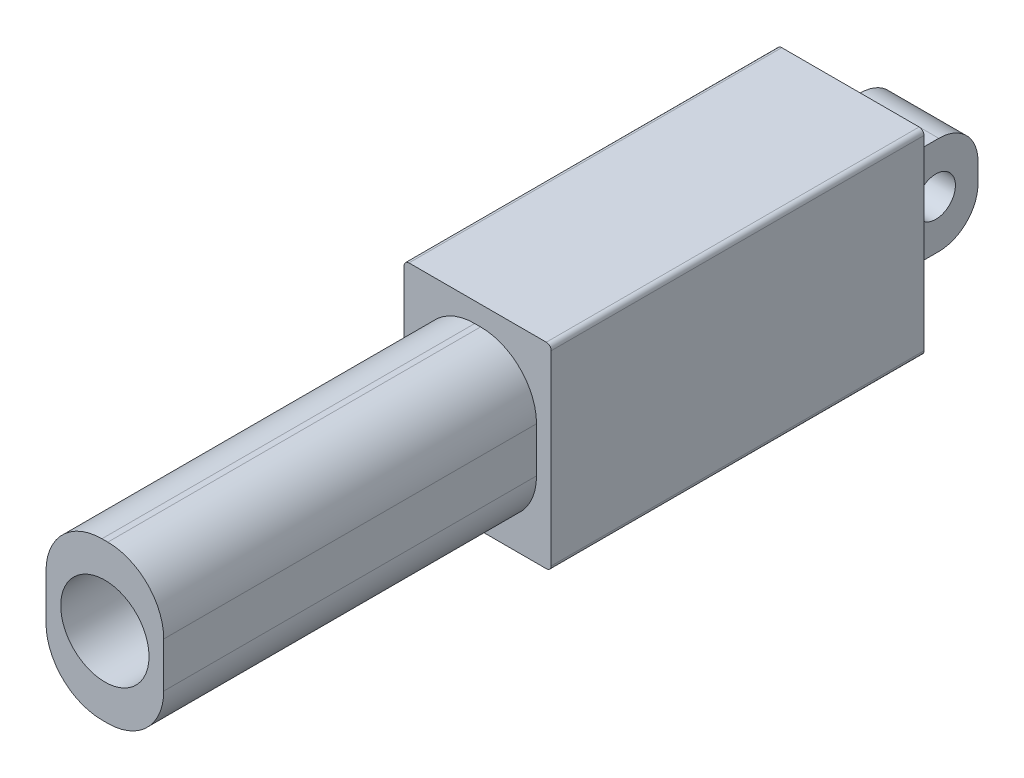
ISO-10303-21;
HEADER;
FILE_DESCRIPTION(('STEP AP214'),'2;1');
FILE_NAME('part.step','',(''),(''),'','','');
FILE_SCHEMA(('AUTOMOTIVE_DESIGN { 1 0 10303 214 1 1 1 1 }'));
ENDSEC;
DATA;
#1=APPLICATION_CONTEXT('core data for automotive mechanical design processes');
#2=APPLICATION_PROTOCOL_DEFINITION('international standard','automotive_design',2000,#1);
#3=PRODUCT_CONTEXT('',#1,'mechanical');
#4=PRODUCT('Part','Part','',(#3));
#5=PRODUCT_RELATED_PRODUCT_CATEGORY('part','',(#4));
#6=PRODUCT_DEFINITION_FORMATION('','',#4);
#7=PRODUCT_DEFINITION_CONTEXT('part definition',#1,'design');
#8=PRODUCT_DEFINITION('design','',#6,#7);
#9=PRODUCT_DEFINITION_SHAPE('','',#8);
#10=(LENGTH_UNIT() NAMED_UNIT(*) SI_UNIT(.MILLI.,.METRE.));
#11=(NAMED_UNIT(*) PLANE_ANGLE_UNIT() SI_UNIT($,.RADIAN.));
#12=(NAMED_UNIT(*) SI_UNIT($,.STERADIAN.) SOLID_ANGLE_UNIT());
#13=UNCERTAINTY_MEASURE_WITH_UNIT(LENGTH_MEASURE(1.E-05),#10,'distance_accuracy_value','');
#14=(GEOMETRIC_REPRESENTATION_CONTEXT(3) GLOBAL_UNCERTAINTY_ASSIGNED_CONTEXT((#13)) GLOBAL_UNIT_ASSIGNED_CONTEXT((#10,
#11,#12)) REPRESENTATION_CONTEXT('',''));
#15=CARTESIAN_POINT('',(0.,0.,0.));
#16=DIRECTION('',(0.,0.,1.));
#17=DIRECTION('',(1.,0.,0.));
#18=AXIS2_PLACEMENT_3D('',#15,#16,#17);
#19=CARTESIAN_POINT('',(0.,0.,0.));
#20=DIRECTION('',(0.,0.,1.));
#21=DIRECTION('',(1.,0.,0.));
#22=AXIS2_PLACEMENT_3D('',#19,#20,#21);
#23=PLANE('',#22);
#24=DIRECTION('',(-1.,0.,0.));
#25=VECTOR('',#24,1.);
#26=CARTESIAN_POINT('',(7.5,10.,0.));
#27=LINE('',#26,#25);
#28=CARTESIAN_POINT('',(7.,10.,0.));
#29=VERTEX_POINT('',#28);
#30=CARTESIAN_POINT('',(-7.,10.,0.));
#31=VERTEX_POINT('',#30);
#32=EDGE_CURVE('E290',#29,#31,#27,.T.);
#33=ORIENTED_EDGE('',*,*,#32,.F.);
#34=CARTESIAN_POINT('',(7.,9.5,0.));
#35=DIRECTION('',(0.,0.,1.));
#36=DIRECTION('',(1.,0.,0.));
#37=AXIS2_PLACEMENT_3D('',#34,#35,#36);
#38=CIRCLE('',#37,0.5);
#39=CARTESIAN_POINT('',(7.5,9.5,0.));
#40=VERTEX_POINT('',#39);
#41=EDGE_CURVE('E338',#29,#40,#38,.F.);
#42=ORIENTED_EDGE('',*,*,#41,.T.);
#43=DIRECTION('',(0.,1.,0.));
#44=VECTOR('',#43,1.);
#45=CARTESIAN_POINT('',(7.5,-10.,0.));
#46=LINE('',#45,#44);
#47=CARTESIAN_POINT('',(7.5,-9.5,0.));
#48=VERTEX_POINT('',#47);
#49=EDGE_CURVE('E303',#48,#40,#46,.T.);
#50=ORIENTED_EDGE('',*,*,#49,.F.);
#51=CARTESIAN_POINT('',(7.,-9.5,0.));
#52=DIRECTION('',(0.,0.,1.));
#53=DIRECTION('',(1.,0.,0.));
#54=AXIS2_PLACEMENT_3D('',#51,#52,#53);
#55=CIRCLE('',#54,0.5);
#56=CARTESIAN_POINT('',(7.,-10.,0.));
#57=VERTEX_POINT('',#56);
#58=EDGE_CURVE('E336',#48,#57,#55,.F.);
#59=ORIENTED_EDGE('',*,*,#58,.T.);
#60=DIRECTION('',(1.,0.,0.));
#61=VECTOR('',#60,1.);
#62=CARTESIAN_POINT('',(7.5,-10.,0.));
#63=LINE('',#62,#61);
#64=CARTESIAN_POINT('',(-7.,-10.,0.));
#65=VERTEX_POINT('',#64);
#66=EDGE_CURVE('E301',#65,#57,#63,.T.);
#67=ORIENTED_EDGE('',*,*,#66,.F.);
#68=CARTESIAN_POINT('',(-7.,-9.5,0.));
#69=DIRECTION('',(0.,0.,1.));
#70=DIRECTION('',(1.,0.,0.));
#71=AXIS2_PLACEMENT_3D('',#68,#69,#70);
#72=CIRCLE('',#71,0.5);
#73=CARTESIAN_POINT('',(-7.5,-9.5,0.));
#74=VERTEX_POINT('',#73);
#75=EDGE_CURVE('E332',#65,#74,#72,.F.);
#76=ORIENTED_EDGE('',*,*,#75,.T.);
#77=DIRECTION('',(0.,-1.,0.));
#78=VECTOR('',#77,1.);
#79=CARTESIAN_POINT('',(-7.5,-10.,0.));
#80=LINE('',#79,#78);
#81=CARTESIAN_POINT('',(-7.5,9.5,0.));
#82=VERTEX_POINT('',#81);
#83=EDGE_CURVE('E286',#82,#74,#80,.T.);
#84=ORIENTED_EDGE('',*,*,#83,.F.);
#85=CARTESIAN_POINT('',(-7.,9.5,0.));
#86=DIRECTION('',(0.,0.,1.));
#87=DIRECTION('',(1.,0.,0.));
#88=AXIS2_PLACEMENT_3D('',#85,#86,#87);
#89=CIRCLE('',#88,0.5);
#90=EDGE_CURVE('E334',#82,#31,#89,.F.);
#91=ORIENTED_EDGE('',*,*,#90,.T.);
#92=EDGE_LOOP('',(#33,#42,#50,#59,#67,#76,#84,#91));
#93=FACE_BOUND('',#92,.T.);
#94=DIRECTION('',(0.,1.,0.));
#95=VECTOR('',#94,1.);
#96=CARTESIAN_POINT('',(-4.,-5.,0.));
#97=LINE('',#96,#95);
#98=CARTESIAN_POINT('',(-4.,-5.,0.));
#99=VERTEX_POINT('',#98);
#100=CARTESIAN_POINT('',(-4.,5.,0.));
#101=VERTEX_POINT('',#100);
#102=EDGE_CURVE('E208',#99,#101,#97,.T.);
#103=ORIENTED_EDGE('',*,*,#102,.F.);
#104=DIRECTION('',(-1.,0.,0.));
#105=VECTOR('',#104,1.);
#106=CARTESIAN_POINT('',(4.,-5.,0.));
#107=LINE('',#106,#105);
#108=CARTESIAN_POINT('',(4.,-5.,0.));
#109=VERTEX_POINT('',#108);
#110=EDGE_CURVE('E204',#109,#99,#107,.T.);
#111=ORIENTED_EDGE('',*,*,#110,.F.);
#112=DIRECTION('',(0.,-1.,0.));
#113=VECTOR('',#112,1.);
#114=CARTESIAN_POINT('',(4.,-5.,0.));
#115=LINE('',#114,#113);
#116=CARTESIAN_POINT('',(4.,5.,0.));
#117=VERTEX_POINT('',#116);
#118=EDGE_CURVE('E188',#117,#109,#115,.T.);
#119=ORIENTED_EDGE('',*,*,#118,.F.);
#120=DIRECTION('',(1.,0.,0.));
#121=VECTOR('',#120,1.);
#122=CARTESIAN_POINT('',(4.,5.,0.));
#123=LINE('',#122,#121);
#124=EDGE_CURVE('E201',#101,#117,#123,.T.);
#125=ORIENTED_EDGE('',*,*,#124,.F.);
#126=EDGE_LOOP('',(#103,#111,#119,#125));
#127=FACE_BOUND('',#126,.T.);
#128=ADVANCED_FACE('F33',(#93,#127),#23,.F.);
#129=CARTESIAN_POINT('',(-7.5,-10.,38.));
#130=DIRECTION('',(1.,0.,0.));
#131=DIRECTION('',(0.,0.,-1.));
#132=AXIS2_PLACEMENT_3D('',#129,#130,#131);
#133=PLANE('',#132);
#134=DIRECTION('',(0.,-1.,0.));
#135=VECTOR('',#134,1.);
#136=CARTESIAN_POINT('',(-7.5,-10.,38.));
#137=LINE('',#136,#135);
#138=CARTESIAN_POINT('',(-7.5,9.5,38.));
#139=VERTEX_POINT('',#138);
#140=CARTESIAN_POINT('',(-7.5,-9.5,38.));
#141=VERTEX_POINT('',#140);
#142=EDGE_CURVE('E287',#139,#141,#137,.T.);
#143=ORIENTED_EDGE('',*,*,#142,.F.);
#144=DIRECTION('',(0.,0.,-1.));
#145=VECTOR('',#144,1.);
#146=CARTESIAN_POINT('',(-7.5,9.5,38.));
#147=LINE('',#146,#145);
#148=EDGE_CURVE('E11',#139,#82,#147,.T.);
#149=ORIENTED_EDGE('',*,*,#148,.T.);
#150=ORIENTED_EDGE('',*,*,#83,.T.);
#151=DIRECTION('',(0.,0.,-1.));
#152=VECTOR('',#151,1.);
#153=CARTESIAN_POINT('',(-7.5,-9.5,38.));
#154=LINE('',#153,#152);
#155=EDGE_CURVE('E41',#74,#141,#154,.F.);
#156=ORIENTED_EDGE('',*,*,#155,.T.);
#157=EDGE_LOOP('',(#143,#149,#150,#156));
#158=FACE_BOUND('',#157,.T.);
#159=ADVANCED_FACE('F358',(#158),#133,.F.);
#160=CARTESIAN_POINT('',(7.5,-10.,38.));
#161=DIRECTION('',(0.,1.,0.));
#162=DIRECTION('',(-1.,0.,0.));
#163=AXIS2_PLACEMENT_3D('',#160,#161,#162);
#164=PLANE('',#163);
#165=ORIENTED_EDGE('',*,*,#66,.T.);
#166=DIRECTION('',(0.,0.,-1.));
#167=VECTOR('',#166,1.);
#168=CARTESIAN_POINT('',(7.,-10.,38.));
#169=LINE('',#168,#167);
#170=CARTESIAN_POINT('',(7.,-10.,38.));
#171=VERTEX_POINT('',#170);
#172=EDGE_CURVE('E48',#57,#171,#169,.F.);
#173=ORIENTED_EDGE('',*,*,#172,.T.);
#174=DIRECTION('',(1.,0.,0.));
#175=VECTOR('',#174,1.);
#176=CARTESIAN_POINT('',(7.5,-10.,38.));
#177=LINE('',#176,#175);
#178=CARTESIAN_POINT('',(-7.,-10.,38.));
#179=VERTEX_POINT('',#178);
#180=EDGE_CURVE('E289',#179,#171,#177,.T.);
#181=ORIENTED_EDGE('',*,*,#180,.F.);
#182=DIRECTION('',(0.,0.,-1.));
#183=VECTOR('',#182,1.);
#184=CARTESIAN_POINT('',(-7.,-10.,38.));
#185=LINE('',#184,#183);
#186=EDGE_CURVE('E352',#179,#65,#185,.T.);
#187=ORIENTED_EDGE('',*,*,#186,.T.);
#188=EDGE_LOOP('',(#165,#173,#181,#187));
#189=FACE_BOUND('',#188,.T.);
#190=ADVANCED_FACE('F366',(#189),#164,.F.);
#191=CARTESIAN_POINT('',(7.5,-10.,38.));
#192=DIRECTION('',(-1.,0.,0.));
#193=DIRECTION('',(0.,0.,1.));
#194=AXIS2_PLACEMENT_3D('',#191,#192,#193);
#195=PLANE('',#194);
#196=ORIENTED_EDGE('',*,*,#49,.T.);
#197=DIRECTION('',(0.,0.,-1.));
#198=VECTOR('',#197,1.);
#199=CARTESIAN_POINT('',(7.5,9.5,38.));
#200=LINE('',#199,#198);
#201=CARTESIAN_POINT('',(7.5,9.5,38.));
#202=VERTEX_POINT('',#201);
#203=EDGE_CURVE('E343',#40,#202,#200,.F.);
#204=ORIENTED_EDGE('',*,*,#203,.T.);
#205=DIRECTION('',(0.,1.,0.));
#206=VECTOR('',#205,1.);
#207=CARTESIAN_POINT('',(7.5,-10.,38.));
#208=LINE('',#207,#206);
#209=CARTESIAN_POINT('',(7.5,-9.5,38.));
#210=VERTEX_POINT('',#209);
#211=EDGE_CURVE('E292',#210,#202,#208,.T.);
#212=ORIENTED_EDGE('',*,*,#211,.F.);
#213=DIRECTION('',(0.,0.,-1.));
#214=VECTOR('',#213,1.);
#215=CARTESIAN_POINT('',(7.5,-9.5,38.));
#216=LINE('',#215,#214);
#217=EDGE_CURVE('E340',#210,#48,#216,.T.);
#218=ORIENTED_EDGE('',*,*,#217,.T.);
#219=EDGE_LOOP('',(#196,#204,#212,#218));
#220=FACE_BOUND('',#219,.T.);
#221=ADVANCED_FACE('F376',(#220),#195,.F.);
#222=CARTESIAN_POINT('',(7.5,10.,38.));
#223=DIRECTION('',(0.,-1.,0.));
#224=DIRECTION('',(1.,0.,0.));
#225=AXIS2_PLACEMENT_3D('',#222,#223,#224);
#226=PLANE('',#225);
#227=DIRECTION('',(-1.,0.,0.));
#228=VECTOR('',#227,1.);
#229=CARTESIAN_POINT('',(7.5,10.,38.));
#230=LINE('',#229,#228);
#231=CARTESIAN_POINT('',(7.,10.,38.));
#232=VERTEX_POINT('',#231);
#233=CARTESIAN_POINT('',(-7.,10.,38.));
#234=VERTEX_POINT('',#233);
#235=EDGE_CURVE('E295',#232,#234,#230,.T.);
#236=ORIENTED_EDGE('',*,*,#235,.F.);
#237=DIRECTION('',(0.,0.,-1.));
#238=VECTOR('',#237,1.);
#239=CARTESIAN_POINT('',(7.,10.,38.));
#240=LINE('',#239,#238);
#241=EDGE_CURVE('E329',#232,#29,#240,.T.);
#242=ORIENTED_EDGE('',*,*,#241,.T.);
#243=ORIENTED_EDGE('',*,*,#32,.T.);
#244=DIRECTION('',(0.,0.,-1.));
#245=VECTOR('',#244,1.);
#246=CARTESIAN_POINT('',(-7.,10.,38.));
#247=LINE('',#246,#245);
#248=EDGE_CURVE('E324',#31,#234,#247,.F.);
#249=ORIENTED_EDGE('',*,*,#248,.T.);
#250=EDGE_LOOP('',(#236,#242,#243,#249));
#251=FACE_BOUND('',#250,.T.);
#252=ADVANCED_FACE('F384',(#251),#226,.F.);
#253=CARTESIAN_POINT('',(0.,0.,38.));
#254=DIRECTION('',(0.,0.,1.));
#255=DIRECTION('',(1.,0.,0.));
#256=AXIS2_PLACEMENT_3D('',#253,#254,#255);
#257=PLANE('',#256);
#258=CARTESIAN_POINT('',(-0.3,-2.3,38.));
#259=DIRECTION('',(0.,0.,1.));
#260=DIRECTION('',(-1.,0.,0.));
#261=AXIS2_PLACEMENT_3D('',#258,#259,#260);
#262=CIRCLE('',#261,5.7);
#263=CARTESIAN_POINT('',(-6.,-2.29999999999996,38.));
#264=VERTEX_POINT('',#263);
#265=CARTESIAN_POINT('',(-0.299999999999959,-8.,38.));
#266=VERTEX_POINT('',#265);
#267=EDGE_CURVE('E221',#264,#266,#262,.T.);
#268=ORIENTED_EDGE('',*,*,#267,.F.);
#269=DIRECTION('',(0.,-1.,0.));
#270=VECTOR('',#269,1.);
#271=CARTESIAN_POINT('',(-6.,-2.29999999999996,38.));
#272=LINE('',#271,#270);
#273=CARTESIAN_POINT('',(-6.,2.29999999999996,38.));
#274=VERTEX_POINT('',#273);
#275=EDGE_CURVE('E226',#274,#264,#272,.T.);
#276=ORIENTED_EDGE('',*,*,#275,.F.);
#277=CARTESIAN_POINT('',(-0.299999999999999,2.3,38.));
#278=DIRECTION('',(0.,0.,1.));
#279=DIRECTION('',(1.,0.,0.));
#280=AXIS2_PLACEMENT_3D('',#277,#278,#279);
#281=CIRCLE('',#280,5.7);
#282=CARTESIAN_POINT('',(-0.299999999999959,8.,38.));
#283=VERTEX_POINT('',#282);
#284=EDGE_CURVE('E258',#283,#274,#281,.T.);
#285=ORIENTED_EDGE('',*,*,#284,.F.);
#286=DIRECTION('',(-1.,0.,0.));
#287=VECTOR('',#286,1.);
#288=CARTESIAN_POINT('',(0.299999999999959,8.,38.));
#289=LINE('',#288,#287);
#290=CARTESIAN_POINT('',(0.299999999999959,8.,38.));
#291=VERTEX_POINT('',#290);
#292=EDGE_CURVE('E255',#291,#283,#289,.T.);
#293=ORIENTED_EDGE('',*,*,#292,.F.);
#294=CARTESIAN_POINT('',(0.3,2.3,38.));
#295=DIRECTION('',(0.,0.,1.));
#296=DIRECTION('',(-1.,0.,0.));
#297=AXIS2_PLACEMENT_3D('',#294,#295,#296);
#298=CIRCLE('',#297,5.7);
#299=CARTESIAN_POINT('',(6.,2.29999999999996,38.));
#300=VERTEX_POINT('',#299);
#301=EDGE_CURVE('E252',#300,#291,#298,.T.);
#302=ORIENTED_EDGE('',*,*,#301,.F.);
#303=DIRECTION('',(0.,1.,0.));
#304=VECTOR('',#303,1.);
#305=CARTESIAN_POINT('',(6.,-2.29999999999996,38.));
#306=LINE('',#305,#304);
#307=CARTESIAN_POINT('',(6.,-2.3,38.));
#308=VERTEX_POINT('',#307);
#309=EDGE_CURVE('E249',#308,#300,#306,.T.);
#310=ORIENTED_EDGE('',*,*,#309,.F.);
#311=CARTESIAN_POINT('',(0.299999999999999,-2.3,38.));
#312=DIRECTION('',(0.,0.,1.));
#313=DIRECTION('',(1.,0.,0.));
#314=AXIS2_PLACEMENT_3D('',#311,#312,#313);
#315=CIRCLE('',#314,5.7);
#316=CARTESIAN_POINT('',(0.299999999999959,-8.,38.));
#317=VERTEX_POINT('',#316);
#318=EDGE_CURVE('E246',#317,#308,#315,.T.);
#319=ORIENTED_EDGE('',*,*,#318,.F.);
#320=DIRECTION('',(1.,0.,0.));
#321=VECTOR('',#320,1.);
#322=CARTESIAN_POINT('',(0.299999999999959,-8.,38.));
#323=LINE('',#322,#321);
#324=EDGE_CURVE('E243',#266,#317,#323,.T.);
#325=ORIENTED_EDGE('',*,*,#324,.F.);
#326=EDGE_LOOP('',(#268,#276,#285,#293,#302,#310,#319,#325));
#327=FACE_BOUND('',#326,.T.);
#328=ORIENTED_EDGE('',*,*,#211,.T.);
#329=CARTESIAN_POINT('',(7.,9.5,38.));
#330=DIRECTION('',(0.,0.,1.));
#331=DIRECTION('',(1.,0.,0.));
#332=AXIS2_PLACEMENT_3D('',#329,#330,#331);
#333=CIRCLE('',#332,0.5);
#334=EDGE_CURVE('E350',#202,#232,#333,.T.);
#335=ORIENTED_EDGE('',*,*,#334,.T.);
#336=ORIENTED_EDGE('',*,*,#235,.T.);
#337=CARTESIAN_POINT('',(-7.,9.5,38.));
#338=DIRECTION('',(0.,0.,1.));
#339=DIRECTION('',(1.,0.,0.));
#340=AXIS2_PLACEMENT_3D('',#337,#338,#339);
#341=CIRCLE('',#340,0.5);
#342=EDGE_CURVE('E346',#234,#139,#341,.T.);
#343=ORIENTED_EDGE('',*,*,#342,.T.);
#344=ORIENTED_EDGE('',*,*,#142,.T.);
#345=CARTESIAN_POINT('',(-7.,-9.5,38.));
#346=DIRECTION('',(0.,0.,1.));
#347=DIRECTION('',(1.,0.,0.));
#348=AXIS2_PLACEMENT_3D('',#345,#346,#347);
#349=CIRCLE('',#348,0.5);
#350=EDGE_CURVE('E55',#141,#179,#349,.T.);
#351=ORIENTED_EDGE('',*,*,#350,.T.);
#352=ORIENTED_EDGE('',*,*,#180,.T.);
#353=CARTESIAN_POINT('',(7.,-9.5,38.));
#354=DIRECTION('',(0.,0.,1.));
#355=DIRECTION('',(1.,0.,0.));
#356=AXIS2_PLACEMENT_3D('',#353,#354,#355);
#357=CIRCLE('',#356,0.5);
#358=EDGE_CURVE('E348',#171,#210,#357,.T.);
#359=ORIENTED_EDGE('',*,*,#358,.T.);
#360=EDGE_LOOP('',(#328,#335,#336,#343,#344,#351,#352,#359));
#361=FACE_BOUND('',#360,.T.);
#362=ADVANCED_FACE('F362',(#327,#361),#257,.T.);
#363=CARTESIAN_POINT('',(-0.3,-2.3,76.));
#364=DIRECTION('',(0.,0.,-1.));
#365=DIRECTION('',(-1.,0.,0.));
#366=AXIS2_PLACEMENT_3D('',#363,#364,#365);
#367=CYLINDRICAL_SURFACE('',#366,5.7);
#368=ORIENTED_EDGE('',*,*,#267,.T.);
#369=DIRECTION('',(0.,0.,-1.));
#370=VECTOR('',#369,1.);
#371=CARTESIAN_POINT('',(-0.299999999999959,-8.,76.));
#372=LINE('',#371,#370);
#373=CARTESIAN_POINT('',(-0.299999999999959,-8.,76.));
#374=VERTEX_POINT('',#373);
#375=EDGE_CURVE('E283',#374,#266,#372,.T.);
#376=ORIENTED_EDGE('',*,*,#375,.F.);
#377=CARTESIAN_POINT('',(-0.3,-2.3,76.));
#378=DIRECTION('',(0.,0.,1.));
#379=DIRECTION('',(-1.,0.,0.));
#380=AXIS2_PLACEMENT_3D('',#377,#378,#379);
#381=CIRCLE('',#380,5.7);
#382=CARTESIAN_POINT('',(-6.,-2.29999999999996,76.));
#383=VERTEX_POINT('',#382);
#384=EDGE_CURVE('E222',#383,#374,#381,.T.);
#385=ORIENTED_EDGE('',*,*,#384,.F.);
#386=DIRECTION('',(0.,0.,-1.));
#387=VECTOR('',#386,1.);
#388=CARTESIAN_POINT('',(-6.,-2.29999999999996,76.));
#389=LINE('',#388,#387);
#390=EDGE_CURVE('E240',#383,#264,#389,.T.);
#391=ORIENTED_EDGE('',*,*,#390,.T.);
#392=EDGE_LOOP('',(#368,#376,#385,#391));
#393=FACE_BOUND('',#392,.T.);
#394=ADVANCED_FACE('F479',(#393),#367,.T.);
#395=CARTESIAN_POINT('',(0.299999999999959,-8.,76.));
#396=DIRECTION('',(0.,1.,0.));
#397=DIRECTION('',(0.,0.,1.));
#398=AXIS2_PLACEMENT_3D('',#395,#396,#397);
#399=PLANE('',#398);
#400=ORIENTED_EDGE('',*,*,#324,.T.);
#401=DIRECTION('',(0.,0.,-1.));
#402=VECTOR('',#401,1.);
#403=CARTESIAN_POINT('',(0.299999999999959,-8.,76.));
#404=LINE('',#403,#402);
#405=CARTESIAN_POINT('',(0.299999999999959,-8.,76.));
#406=VERTEX_POINT('',#405);
#407=EDGE_CURVE('E280',#406,#317,#404,.T.);
#408=ORIENTED_EDGE('',*,*,#407,.F.);
#409=DIRECTION('',(1.,0.,0.));
#410=VECTOR('',#409,1.);
#411=CARTESIAN_POINT('',(0.299999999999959,-8.,76.));
#412=LINE('',#411,#410);
#413=EDGE_CURVE('E225',#374,#406,#412,.T.);
#414=ORIENTED_EDGE('',*,*,#413,.F.);
#415=ORIENTED_EDGE('',*,*,#375,.T.);
#416=EDGE_LOOP('',(#400,#408,#414,#415));
#417=FACE_BOUND('',#416,.T.);
#418=ADVANCED_FACE('F476',(#417),#399,.F.);
#419=CARTESIAN_POINT('',(0.299999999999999,-2.3,76.));
#420=DIRECTION('',(0.,0.,-1.));
#421=DIRECTION('',(-1.,0.,0.));
#422=AXIS2_PLACEMENT_3D('',#419,#420,#421);
#423=CYLINDRICAL_SURFACE('',#422,5.7);
#424=ORIENTED_EDGE('',*,*,#318,.T.);
#425=DIRECTION('',(0.,0.,-1.));
#426=VECTOR('',#425,1.);
#427=CARTESIAN_POINT('',(6.,-2.3,76.));
#428=LINE('',#427,#426);
#429=CARTESIAN_POINT('',(6.,-2.3,76.));
#430=VERTEX_POINT('',#429);
#431=EDGE_CURVE('E277',#430,#308,#428,.T.);
#432=ORIENTED_EDGE('',*,*,#431,.F.);
#433=CARTESIAN_POINT('',(0.299999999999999,-2.3,76.));
#434=DIRECTION('',(0.,0.,1.));
#435=DIRECTION('',(1.,0.,0.));
#436=AXIS2_PLACEMENT_3D('',#433,#434,#435);
#437=CIRCLE('',#436,5.7);
#438=EDGE_CURVE('E228',#406,#430,#437,.T.);
#439=ORIENTED_EDGE('',*,*,#438,.F.);
#440=ORIENTED_EDGE('',*,*,#407,.T.);
#441=EDGE_LOOP('',(#424,#432,#439,#440));
#442=FACE_BOUND('',#441,.T.);
#443=ADVANCED_FACE('F472',(#442),#423,.T.);
#444=CARTESIAN_POINT('',(6.,-2.29999999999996,76.));
#445=DIRECTION('',(-1.,0.,0.));
#446=DIRECTION('',(0.,0.,1.));
#447=AXIS2_PLACEMENT_3D('',#444,#445,#446);
#448=PLANE('',#447);
#449=ORIENTED_EDGE('',*,*,#309,.T.);
#450=DIRECTION('',(0.,0.,-1.));
#451=VECTOR('',#450,1.);
#452=CARTESIAN_POINT('',(6.,2.29999999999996,76.));
#453=LINE('',#452,#451);
#454=CARTESIAN_POINT('',(6.,2.29999999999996,76.));
#455=VERTEX_POINT('',#454);
#456=EDGE_CURVE('E274',#455,#300,#453,.T.);
#457=ORIENTED_EDGE('',*,*,#456,.F.);
#458=DIRECTION('',(0.,1.,0.));
#459=VECTOR('',#458,1.);
#460=CARTESIAN_POINT('',(6.,-2.29999999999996,76.));
#461=LINE('',#460,#459);
#462=EDGE_CURVE('E230',#430,#455,#461,.T.);
#463=ORIENTED_EDGE('',*,*,#462,.F.);
#464=ORIENTED_EDGE('',*,*,#431,.T.);
#465=EDGE_LOOP('',(#449,#457,#463,#464));
#466=FACE_BOUND('',#465,.T.);
#467=ADVANCED_FACE('F468',(#466),#448,.F.);
#468=CARTESIAN_POINT('',(0.3,2.3,76.));
#469=DIRECTION('',(0.,0.,-1.));
#470=DIRECTION('',(-1.,0.,0.));
#471=AXIS2_PLACEMENT_3D('',#468,#469,#470);
#472=CYLINDRICAL_SURFACE('',#471,5.7);
#473=ORIENTED_EDGE('',*,*,#301,.T.);
#474=DIRECTION('',(0.,0.,-1.));
#475=VECTOR('',#474,1.);
#476=CARTESIAN_POINT('',(0.299999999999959,8.,76.));
#477=LINE('',#476,#475);
#478=CARTESIAN_POINT('',(0.299999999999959,8.,76.));
#479=VERTEX_POINT('',#478);
#480=EDGE_CURVE('E271',#479,#291,#477,.T.);
#481=ORIENTED_EDGE('',*,*,#480,.F.);
#482=CARTESIAN_POINT('',(0.3,2.3,76.));
#483=DIRECTION('',(0.,0.,1.));
#484=DIRECTION('',(-1.,0.,0.));
#485=AXIS2_PLACEMENT_3D('',#482,#483,#484);
#486=CIRCLE('',#485,5.7);
#487=EDGE_CURVE('E232',#455,#479,#486,.T.);
#488=ORIENTED_EDGE('',*,*,#487,.F.);
#489=ORIENTED_EDGE('',*,*,#456,.T.);
#490=EDGE_LOOP('',(#473,#481,#488,#489));
#491=FACE_BOUND('',#490,.T.);
#492=ADVANCED_FACE('F464',(#491),#472,.T.);
#493=CARTESIAN_POINT('',(0.299999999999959,8.,76.));
#494=DIRECTION('',(0.,-1.,0.));
#495=DIRECTION('',(0.,0.,-1.));
#496=AXIS2_PLACEMENT_3D('',#493,#494,#495);
#497=PLANE('',#496);
#498=ORIENTED_EDGE('',*,*,#292,.T.);
#499=DIRECTION('',(0.,0.,-1.));
#500=VECTOR('',#499,1.);
#501=CARTESIAN_POINT('',(-0.299999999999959,8.,76.));
#502=LINE('',#501,#500);
#503=CARTESIAN_POINT('',(-0.299999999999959,8.,76.));
#504=VERTEX_POINT('',#503);
#505=EDGE_CURVE('E268',#504,#283,#502,.T.);
#506=ORIENTED_EDGE('',*,*,#505,.F.);
#507=DIRECTION('',(-1.,0.,0.));
#508=VECTOR('',#507,1.);
#509=CARTESIAN_POINT('',(0.299999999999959,8.,76.));
#510=LINE('',#509,#508);
#511=EDGE_CURVE('E234',#479,#504,#510,.T.);
#512=ORIENTED_EDGE('',*,*,#511,.F.);
#513=ORIENTED_EDGE('',*,*,#480,.T.);
#514=EDGE_LOOP('',(#498,#506,#512,#513));
#515=FACE_BOUND('',#514,.T.);
#516=ADVANCED_FACE('F460',(#515),#497,.F.);
#517=CARTESIAN_POINT('',(-0.299999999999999,2.3,76.));
#518=DIRECTION('',(0.,0.,-1.));
#519=DIRECTION('',(-1.,0.,0.));
#520=AXIS2_PLACEMENT_3D('',#517,#518,#519);
#521=CYLINDRICAL_SURFACE('',#520,5.7);
#522=ORIENTED_EDGE('',*,*,#284,.T.);
#523=DIRECTION('',(0.,0.,-1.));
#524=VECTOR('',#523,1.);
#525=CARTESIAN_POINT('',(-6.,2.29999999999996,76.));
#526=LINE('',#525,#524);
#527=CARTESIAN_POINT('',(-6.,2.29999999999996,76.));
#528=VERTEX_POINT('',#527);
#529=EDGE_CURVE('E265',#528,#274,#526,.T.);
#530=ORIENTED_EDGE('',*,*,#529,.F.);
#531=CARTESIAN_POINT('',(-0.299999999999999,2.3,76.));
#532=DIRECTION('',(0.,0.,1.));
#533=DIRECTION('',(1.,0.,0.));
#534=AXIS2_PLACEMENT_3D('',#531,#532,#533);
#535=CIRCLE('',#534,5.7);
#536=EDGE_CURVE('E236',#504,#528,#535,.T.);
#537=ORIENTED_EDGE('',*,*,#536,.F.);
#538=ORIENTED_EDGE('',*,*,#505,.T.);
#539=EDGE_LOOP('',(#522,#530,#537,#538));
#540=FACE_BOUND('',#539,.T.);
#541=ADVANCED_FACE('F456',(#540),#521,.T.);
#542=CARTESIAN_POINT('',(-6.,-2.29999999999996,76.));
#543=DIRECTION('',(1.,0.,0.));
#544=DIRECTION('',(0.,0.,-1.));
#545=AXIS2_PLACEMENT_3D('',#542,#543,#544);
#546=PLANE('',#545);
#547=ORIENTED_EDGE('',*,*,#275,.T.);
#548=ORIENTED_EDGE('',*,*,#390,.F.);
#549=DIRECTION('',(0.,-1.,0.));
#550=VECTOR('',#549,1.);
#551=CARTESIAN_POINT('',(-6.,-2.29999999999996,76.));
#552=LINE('',#551,#550);
#553=EDGE_CURVE('E238',#528,#383,#552,.T.);
#554=ORIENTED_EDGE('',*,*,#553,.F.);
#555=ORIENTED_EDGE('',*,*,#529,.T.);
#556=EDGE_LOOP('',(#547,#548,#554,#555));
#557=FACE_BOUND('',#556,.T.);
#558=ADVANCED_FACE('F452',(#557),#546,.F.);
#559=CARTESIAN_POINT('',(-0.3,-2.3,76.));
#560=DIRECTION('',(0.,0.,-1.));
#561=DIRECTION('',(-1.,0.,0.));
#562=AXIS2_PLACEMENT_3D('',#559,#560,#561);
#563=PLANE('',#562);
#564=CARTESIAN_POINT('',(0.,0.,76.));
#565=DIRECTION('',(0.,0.,1.));
#566=DIRECTION('',(1.,0.,0.));
#567=AXIS2_PLACEMENT_3D('',#564,#565,#566);
#568=CIRCLE('',#567,4.5);
#569=CARTESIAN_POINT('',(4.5,0.,76.));
#570=VERTEX_POINT('',#569);
#571=EDGE_CURVE('E659',#570,#570,#568,.T.);
#572=ORIENTED_EDGE('',*,*,#571,.F.);
#573=EDGE_LOOP('',(#572));
#574=FACE_BOUND('',#573,.T.);
#575=ORIENTED_EDGE('',*,*,#384,.T.);
#576=ORIENTED_EDGE('',*,*,#413,.T.);
#577=ORIENTED_EDGE('',*,*,#438,.T.);
#578=ORIENTED_EDGE('',*,*,#462,.T.);
#579=ORIENTED_EDGE('',*,*,#487,.T.);
#580=ORIENTED_EDGE('',*,*,#511,.T.);
#581=ORIENTED_EDGE('',*,*,#536,.T.);
#582=ORIENTED_EDGE('',*,*,#553,.T.);
#583=EDGE_LOOP('',(#575,#576,#577,#578,#579,#580,#581,#582));
#584=FACE_BOUND('',#583,.T.);
#585=ADVANCED_FACE('F448',(#574,#584),#563,.F.);
#586=CARTESIAN_POINT('',(-4.,-5.,-9.));
#587=DIRECTION('',(1.,0.,0.));
#588=DIRECTION('',(0.,0.,-1.));
#589=AXIS2_PLACEMENT_3D('',#586,#587,#588);
#590=PLANE('',#589);
#591=CARTESIAN_POINT('',(-4.,0.,-4.7));
#592=DIRECTION('',(-1.,0.,0.));
#593=DIRECTION('',(0.,0.,1.));
#594=AXIS2_PLACEMENT_3D('',#591,#592,#593);
#595=CIRCLE('',#594,2.);
#596=CARTESIAN_POINT('',(-4.,0.,-2.7));
#597=VERTEX_POINT('',#596);
#598=EDGE_CURVE('E327',#597,#597,#595,.T.);
#599=ORIENTED_EDGE('',*,*,#598,.F.);
#600=EDGE_LOOP('',(#599));
#601=FACE_BOUND('',#600,.T.);
#602=DIRECTION('',(0.,1.,0.));
#603=VECTOR('',#602,1.);
#604=CARTESIAN_POINT('',(-4.,-5.,-9.));
#605=LINE('',#604,#603);
#606=CARTESIAN_POINT('',(-4.,-1.,-9.));
#607=VERTEX_POINT('',#606);
#608=CARTESIAN_POINT('',(-4.,1.,-9.));
#609=VERTEX_POINT('',#608);
#610=EDGE_CURVE('E215',#607,#609,#605,.T.);
#611=ORIENTED_EDGE('',*,*,#610,.F.);
#612=CARTESIAN_POINT('',(-4.,-1.,-5.));
#613=DIRECTION('',(1.,0.,0.));
#614=DIRECTION('',(0.,0.,-1.));
#615=AXIS2_PLACEMENT_3D('',#612,#613,#614);
#616=CIRCLE('',#615,4.);
#617=CARTESIAN_POINT('',(-4.,-5.,-5.));
#618=VERTEX_POINT('',#617);
#619=EDGE_CURVE('E315',#607,#618,#616,.F.);
#620=ORIENTED_EDGE('',*,*,#619,.T.);
#621=DIRECTION('',(0.,0.,1.));
#622=VECTOR('',#621,1.);
#623=CARTESIAN_POINT('',(-4.,-5.,-9.));
#624=LINE('',#623,#622);
#625=EDGE_CURVE('E216',#618,#99,#624,.T.);
#626=ORIENTED_EDGE('',*,*,#625,.T.);
#627=ORIENTED_EDGE('',*,*,#102,.T.);
#628=DIRECTION('',(0.,0.,1.));
#629=VECTOR('',#628,1.);
#630=CARTESIAN_POINT('',(-4.,5.,-9.));
#631=LINE('',#630,#629);
#632=CARTESIAN_POINT('',(-4.,5.,-5.));
#633=VERTEX_POINT('',#632);
#634=EDGE_CURVE('E194',#633,#101,#631,.T.);
#635=ORIENTED_EDGE('',*,*,#634,.F.);
#636=CARTESIAN_POINT('',(-4.,1.,-5.));
#637=DIRECTION('',(1.,0.,0.));
#638=DIRECTION('',(0.,0.,-1.));
#639=AXIS2_PLACEMENT_3D('',#636,#637,#638);
#640=CIRCLE('',#639,4.);
#641=EDGE_CURVE('E313',#633,#609,#640,.F.);
#642=ORIENTED_EDGE('',*,*,#641,.T.);
#643=EDGE_LOOP('',(#611,#620,#626,#627,#635,#642));
#644=FACE_BOUND('',#643,.T.);
#645=ADVANCED_FACE('F445',(#601,#644),#590,.F.);
#646=CARTESIAN_POINT('',(4.,5.,-9.));
#647=DIRECTION('',(0.,-1.,0.));
#648=DIRECTION('',(0.,0.,-1.));
#649=AXIS2_PLACEMENT_3D('',#646,#647,#648);
#650=PLANE('',#649);
#651=DIRECTION('',(0.,0.,1.));
#652=VECTOR('',#651,1.);
#653=CARTESIAN_POINT('',(4.,5.,-9.));
#654=LINE('',#653,#652);
#655=CARTESIAN_POINT('',(4.,5.,-5.));
#656=VERTEX_POINT('',#655);
#657=EDGE_CURVE('E184',#656,#117,#654,.T.);
#658=ORIENTED_EDGE('',*,*,#657,.F.);
#659=DIRECTION('',(1.,0.,0.));
#660=VECTOR('',#659,1.);
#661=CARTESIAN_POINT('',(4.,5.,-5.));
#662=LINE('',#661,#660);
#663=EDGE_CURVE('E322',#656,#633,#662,.F.);
#664=ORIENTED_EDGE('',*,*,#663,.T.);
#665=ORIENTED_EDGE('',*,*,#634,.T.);
#666=ORIENTED_EDGE('',*,*,#124,.T.);
#667=EDGE_LOOP('',(#658,#664,#665,#666));
#668=FACE_BOUND('',#667,.T.);
#669=ADVANCED_FACE('F206',(#668),#650,.F.);
#670=CARTESIAN_POINT('',(4.,-5.,-9.));
#671=DIRECTION('',(-1.,0.,0.));
#672=DIRECTION('',(0.,0.,1.));
#673=AXIS2_PLACEMENT_3D('',#670,#671,#672);
#674=PLANE('',#673);
#675=CARTESIAN_POINT('',(4.,0.,-4.7));
#676=DIRECTION('',(-1.,0.,0.));
#677=DIRECTION('',(0.,0.,1.));
#678=AXIS2_PLACEMENT_3D('',#675,#676,#677);
#679=CIRCLE('',#678,2.);
#680=CARTESIAN_POINT('',(4.,0.,-2.7));
#681=VERTEX_POINT('',#680);
#682=EDGE_CURVE('E210',#681,#681,#679,.T.);
#683=ORIENTED_EDGE('',*,*,#682,.T.);
#684=EDGE_LOOP('',(#683));
#685=FACE_BOUND('',#684,.T.);
#686=DIRECTION('',(0.,0.,1.));
#687=VECTOR('',#686,1.);
#688=CARTESIAN_POINT('',(4.,-5.,-9.));
#689=LINE('',#688,#687);
#690=CARTESIAN_POINT('',(4.,-5.,-5.));
#691=VERTEX_POINT('',#690);
#692=EDGE_CURVE('E195',#691,#109,#689,.T.);
#693=ORIENTED_EDGE('',*,*,#692,.F.);
#694=CARTESIAN_POINT('',(4.,-1.,-5.));
#695=DIRECTION('',(-1.,0.,0.));
#696=DIRECTION('',(0.,0.,1.));
#697=AXIS2_PLACEMENT_3D('',#694,#695,#696);
#698=CIRCLE('',#697,4.);
#699=CARTESIAN_POINT('',(4.,-1.,-9.));
#700=VERTEX_POINT('',#699);
#701=EDGE_CURVE('E320',#691,#700,#698,.F.);
#702=ORIENTED_EDGE('',*,*,#701,.T.);
#703=DIRECTION('',(0.,-1.,0.));
#704=VECTOR('',#703,1.);
#705=CARTESIAN_POINT('',(4.,-5.,-9.));
#706=LINE('',#705,#704);
#707=CARTESIAN_POINT('',(4.,1.,-9.));
#708=VERTEX_POINT('',#707);
#709=EDGE_CURVE('E218',#708,#700,#706,.T.);
#710=ORIENTED_EDGE('',*,*,#709,.F.);
#711=CARTESIAN_POINT('',(4.,1.,-5.));
#712=DIRECTION('',(-1.,0.,0.));
#713=DIRECTION('',(0.,0.,1.));
#714=AXIS2_PLACEMENT_3D('',#711,#712,#713);
#715=CIRCLE('',#714,4.);
#716=EDGE_CURVE('E190',#708,#656,#715,.F.);
#717=ORIENTED_EDGE('',*,*,#716,.T.);
#718=ORIENTED_EDGE('',*,*,#657,.T.);
#719=ORIENTED_EDGE('',*,*,#118,.T.);
#720=EDGE_LOOP('',(#693,#702,#710,#717,#718,#719));
#721=FACE_BOUND('',#720,.T.);
#722=ADVANCED_FACE('F187',(#685,#721),#674,.F.);
#723=CARTESIAN_POINT('',(4.,-5.,-9.));
#724=DIRECTION('',(0.,1.,0.));
#725=DIRECTION('',(0.,0.,1.));
#726=AXIS2_PLACEMENT_3D('',#723,#724,#725);
#727=PLANE('',#726);
#728=ORIENTED_EDGE('',*,*,#625,.F.);
#729=DIRECTION('',(-1.,0.,0.));
#730=VECTOR('',#729,1.);
#731=CARTESIAN_POINT('',(4.,-5.,-5.));
#732=LINE('',#731,#730);
#733=EDGE_CURVE('E317',#618,#691,#732,.F.);
#734=ORIENTED_EDGE('',*,*,#733,.T.);
#735=ORIENTED_EDGE('',*,*,#692,.T.);
#736=ORIENTED_EDGE('',*,*,#110,.T.);
#737=EDGE_LOOP('',(#728,#734,#735,#736));
#738=FACE_BOUND('',#737,.T.);
#739=ADVANCED_FACE('F435',(#738),#727,.F.);
#740=CARTESIAN_POINT('',(0.,0.,-9.));
#741=DIRECTION('',(0.,0.,1.));
#742=DIRECTION('',(1.,0.,0.));
#743=AXIS2_PLACEMENT_3D('',#740,#741,#742);
#744=PLANE('',#743);
#745=ORIENTED_EDGE('',*,*,#709,.T.);
#746=DIRECTION('',(-1.,0.,0.));
#747=VECTOR('',#746,1.);
#748=CARTESIAN_POINT('',(0.,-1.,-9.));
#749=LINE('',#748,#747);
#750=EDGE_CURVE('E310',#700,#607,#749,.T.);
#751=ORIENTED_EDGE('',*,*,#750,.T.);
#752=ORIENTED_EDGE('',*,*,#610,.T.);
#753=DIRECTION('',(1.,0.,0.));
#754=VECTOR('',#753,1.);
#755=CARTESIAN_POINT('',(0.,1.,-9.));
#756=LINE('',#755,#754);
#757=EDGE_CURVE('E298',#609,#708,#756,.T.);
#758=ORIENTED_EDGE('',*,*,#757,.T.);
#759=EDGE_LOOP('',(#745,#751,#752,#758));
#760=FACE_BOUND('',#759,.T.);
#761=ADVANCED_FACE('F414',(#760),#744,.F.);
#762=CARTESIAN_POINT('',(0.,-1.,-5.));
#763=DIRECTION('',(-1.,0.,0.));
#764=DIRECTION('',(0.,0.,1.));
#765=AXIS2_PLACEMENT_3D('',#762,#763,#764);
#766=CYLINDRICAL_SURFACE('',#765,4.);
#767=ORIENTED_EDGE('',*,*,#701,.F.);
#768=ORIENTED_EDGE('',*,*,#733,.F.);
#769=ORIENTED_EDGE('',*,*,#619,.F.);
#770=ORIENTED_EDGE('',*,*,#750,.F.);
#771=EDGE_LOOP('',(#767,#768,#769,#770));
#772=FACE_BOUND('',#771,.T.);
#773=ADVANCED_FACE('F410',(#772),#766,.T.);
#774=CARTESIAN_POINT('',(0.,1.,-5.));
#775=DIRECTION('',(1.,0.,0.));
#776=DIRECTION('',(0.,0.,-1.));
#777=AXIS2_PLACEMENT_3D('',#774,#775,#776);
#778=CYLINDRICAL_SURFACE('',#777,4.);
#779=ORIENTED_EDGE('',*,*,#641,.F.);
#780=ORIENTED_EDGE('',*,*,#663,.F.);
#781=ORIENTED_EDGE('',*,*,#716,.F.);
#782=ORIENTED_EDGE('',*,*,#757,.F.);
#783=EDGE_LOOP('',(#779,#780,#781,#782));
#784=FACE_BOUND('',#783,.T.);
#785=ADVANCED_FACE('F413',(#784),#778,.T.);
#786=CARTESIAN_POINT('',(7.5,0.,-4.7));
#787=DIRECTION('',(-1.,0.,0.));
#788=DIRECTION('',(0.,0.,1.));
#789=AXIS2_PLACEMENT_3D('',#786,#787,#788);
#790=CYLINDRICAL_SURFACE('',#789,2.);
#791=ORIENTED_EDGE('',*,*,#598,.T.);
#792=EDGE_LOOP('',(#791));
#793=FACE_BOUND('',#792,.T.);
#794=ORIENTED_EDGE('',*,*,#682,.F.);
#795=EDGE_LOOP('',(#794));
#796=FACE_BOUND('',#795,.T.);
#797=ADVANCED_FACE('F418',(#793,#796),#790,.F.);
#798=CARTESIAN_POINT('',(7.,9.5,38.));
#799=DIRECTION('',(0.,0.,-1.));
#800=DIRECTION('',(-1.,0.,0.));
#801=AXIS2_PLACEMENT_3D('',#798,#799,#800);
#802=CYLINDRICAL_SURFACE('',#801,0.5);
#803=ORIENTED_EDGE('',*,*,#334,.F.);
#804=ORIENTED_EDGE('',*,*,#203,.F.);
#805=ORIENTED_EDGE('',*,*,#41,.F.);
#806=ORIENTED_EDGE('',*,*,#241,.F.);
#807=EDGE_LOOP('',(#803,#804,#805,#806));
#808=FACE_BOUND('',#807,.T.);
#809=ADVANCED_FACE('F382',(#808),#802,.T.);
#810=CARTESIAN_POINT('',(7.,-9.5,38.));
#811=DIRECTION('',(0.,0.,-1.));
#812=DIRECTION('',(-1.,0.,0.));
#813=AXIS2_PLACEMENT_3D('',#810,#811,#812);
#814=CYLINDRICAL_SURFACE('',#813,0.5);
#815=ORIENTED_EDGE('',*,*,#358,.F.);
#816=ORIENTED_EDGE('',*,*,#172,.F.);
#817=ORIENTED_EDGE('',*,*,#58,.F.);
#818=ORIENTED_EDGE('',*,*,#217,.F.);
#819=EDGE_LOOP('',(#815,#816,#817,#818));
#820=FACE_BOUND('',#819,.T.);
#821=ADVANCED_FACE('F373',(#820),#814,.T.);
#822=CARTESIAN_POINT('',(-7.,9.5,38.));
#823=DIRECTION('',(0.,0.,-1.));
#824=DIRECTION('',(-1.,0.,0.));
#825=AXIS2_PLACEMENT_3D('',#822,#823,#824);
#826=CYLINDRICAL_SURFACE('',#825,0.5);
#827=ORIENTED_EDGE('',*,*,#342,.F.);
#828=ORIENTED_EDGE('',*,*,#248,.F.);
#829=ORIENTED_EDGE('',*,*,#90,.F.);
#830=ORIENTED_EDGE('',*,*,#148,.F.);
#831=EDGE_LOOP('',(#827,#828,#829,#830));
#832=FACE_BOUND('',#831,.T.);
#833=ADVANCED_FACE('F387',(#832),#826,.T.);
#834=CARTESIAN_POINT('',(-7.,-9.5,38.));
#835=DIRECTION('',(0.,0.,-1.));
#836=DIRECTION('',(-1.,0.,0.));
#837=AXIS2_PLACEMENT_3D('',#834,#835,#836);
#838=CYLINDRICAL_SURFACE('',#837,0.5);
#839=ORIENTED_EDGE('',*,*,#350,.F.);
#840=ORIENTED_EDGE('',*,*,#155,.F.);
#841=ORIENTED_EDGE('',*,*,#75,.F.);
#842=ORIENTED_EDGE('',*,*,#186,.F.);
#843=EDGE_LOOP('',(#839,#840,#841,#842));
#844=FACE_BOUND('',#843,.T.);
#845=ADVANCED_FACE('F35',(#844),#838,.T.);
#846=CARTESIAN_POINT('',(0.,0.,41.));
#847=DIRECTION('',(0.,0.,1.));
#848=DIRECTION('',(1.,0.,0.));
#849=AXIS2_PLACEMENT_3D('',#846,#847,#848);
#850=CYLINDRICAL_SURFACE('',#849,4.5);
#851=CARTESIAN_POINT('',(0.,0.,41.));
#852=DIRECTION('',(0.,0.,1.));
#853=DIRECTION('',(1.,0.,0.));
#854=AXIS2_PLACEMENT_3D('',#851,#852,#853);
#855=CIRCLE('',#854,4.5);
#856=CARTESIAN_POINT('',(4.5,0.,41.));
#857=VERTEX_POINT('',#856);
#858=EDGE_CURVE('E658',#857,#857,#855,.T.);
#859=ORIENTED_EDGE('',*,*,#858,.F.);
#860=EDGE_LOOP('',(#859));
#861=FACE_BOUND('',#860,.T.);
#862=ORIENTED_EDGE('',*,*,#571,.T.);
#863=EDGE_LOOP('',(#862));
#864=FACE_BOUND('',#863,.T.);
#865=ADVANCED_FACE('F393',(#861,#864),#850,.F.);
#866=CARTESIAN_POINT('',(0.,0.,41.));
#867=DIRECTION('',(0.,0.,1.));
#868=DIRECTION('',(1.,0.,0.));
#869=AXIS2_PLACEMENT_3D('',#866,#867,#868);
#870=PLANE('',#869);
#871=ORIENTED_EDGE('',*,*,#858,.T.);
#872=EDGE_LOOP('',(#871));
#873=FACE_BOUND('',#872,.T.);
#874=ADVANCED_FACE('F644',(#873),#870,.T.);
#875=CLOSED_SHELL('',(#128,#159,#190,#221,#252,#362,#394,#418,#443,#467,#492,#516,#541,#558,
#585,#645,#669,#722,#739,#761,#773,#785,#797,#809,#821,#833,#845,#865,#874));
#876=MANIFOLD_SOLID_BREP('B2',#875);
#877=ADVANCED_BREP_SHAPE_REPRESENTATION('',(#18,#876),#14);
#878=SHAPE_DEFINITION_REPRESENTATION(#9,#877);
ENDSEC;
END-ISO-10303-21;
